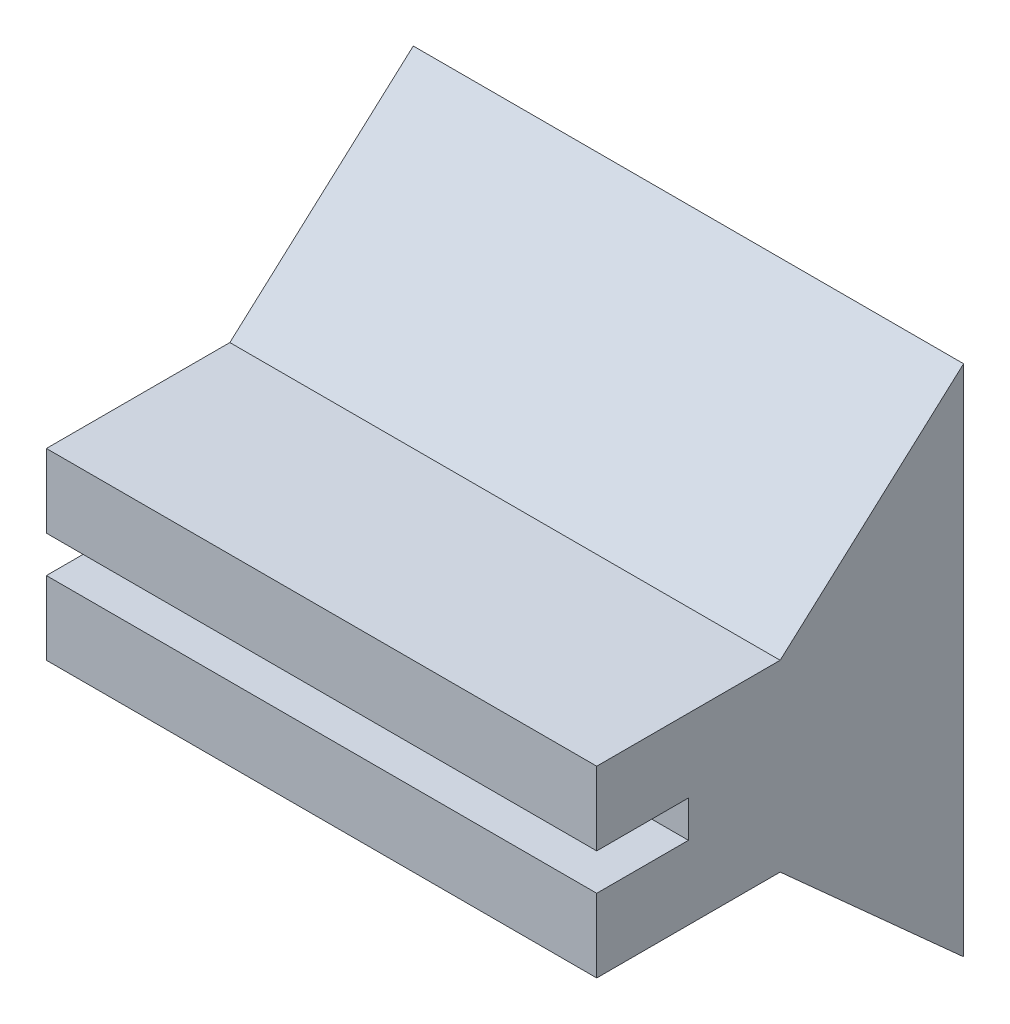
ISO-10303-21;
HEADER;
FILE_DESCRIPTION(('STEP AP214'),'2;1');
FILE_NAME('part.step','',(''),(''),'','','');
FILE_SCHEMA(('AUTOMOTIVE_DESIGN { 1 0 10303 214 1 1 1 1 }'));
ENDSEC;
DATA;
#1=APPLICATION_CONTEXT('core data for automotive mechanical design processes');
#2=APPLICATION_PROTOCOL_DEFINITION('international standard','automotive_design',2000,#1);
#3=PRODUCT_CONTEXT('',#1,'mechanical');
#4=PRODUCT('Part','Part','',(#3));
#5=PRODUCT_RELATED_PRODUCT_CATEGORY('part','',(#4));
#6=PRODUCT_DEFINITION_FORMATION('','',#4);
#7=PRODUCT_DEFINITION_CONTEXT('part definition',#1,'design');
#8=PRODUCT_DEFINITION('design','',#6,#7);
#9=PRODUCT_DEFINITION_SHAPE('','',#8);
#10=(LENGTH_UNIT() NAMED_UNIT(*) SI_UNIT(.MILLI.,.METRE.));
#11=(NAMED_UNIT(*) PLANE_ANGLE_UNIT() SI_UNIT($,.RADIAN.));
#12=(NAMED_UNIT(*) SI_UNIT($,.STERADIAN.) SOLID_ANGLE_UNIT());
#13=UNCERTAINTY_MEASURE_WITH_UNIT(LENGTH_MEASURE(1.E-05),#10,'distance_accuracy_value','');
#14=(GEOMETRIC_REPRESENTATION_CONTEXT(3) GLOBAL_UNCERTAINTY_ASSIGNED_CONTEXT((#13)) GLOBAL_UNIT_ASSIGNED_CONTEXT((#10,
#11,#12)) REPRESENTATION_CONTEXT('',''));
#15=CARTESIAN_POINT('',(0.,0.,0.));
#16=DIRECTION('',(0.,0.,1.));
#17=DIRECTION('',(1.,0.,0.));
#18=AXIS2_PLACEMENT_3D('',#15,#16,#17);
#19=CARTESIAN_POINT('',(-15.,-5.,20.));
#20=DIRECTION('',(0.,1.,0.));
#21=DIRECTION('',(0.,0.,1.));
#22=AXIS2_PLACEMENT_3D('',#19,#20,#21);
#23=PLANE('',#22);
#24=DIRECTION('',(-1.,0.,0.));
#25=VECTOR('',#24,1.);
#26=CARTESIAN_POINT('',(15.,-5.,10.));
#27=LINE('',#26,#25);
#28=CARTESIAN_POINT('',(15.,-5.,10.));
#29=VERTEX_POINT('',#28);
#30=CARTESIAN_POINT('',(-15.,-5.,10.));
#31=VERTEX_POINT('',#30);
#32=EDGE_CURVE('E62',#29,#31,#27,.T.);
#33=ORIENTED_EDGE('',*,*,#32,.F.);
#34=DIRECTION('',(0.,0.,-1.));
#35=VECTOR('',#34,1.);
#36=CARTESIAN_POINT('',(15.,-5.,20.));
#37=LINE('',#36,#35);
#38=CARTESIAN_POINT('',(15.,-5.,20.));
#39=VERTEX_POINT('',#38);
#40=EDGE_CURVE('E187',#39,#29,#37,.T.);
#41=ORIENTED_EDGE('',*,*,#40,.F.);
#42=DIRECTION('',(1.,0.,0.));
#43=VECTOR('',#42,1.);
#44=CARTESIAN_POINT('',(-15.,-5.,20.));
#45=LINE('',#44,#43);
#46=CARTESIAN_POINT('',(-15.,-5.,20.));
#47=VERTEX_POINT('',#46);
#48=EDGE_CURVE('E185',#47,#39,#45,.T.);
#49=ORIENTED_EDGE('',*,*,#48,.F.);
#50=DIRECTION('',(0.,0.,-1.));
#51=VECTOR('',#50,1.);
#52=CARTESIAN_POINT('',(-15.,-5.,20.));
#53=LINE('',#52,#51);
#54=EDGE_CURVE('E190',#47,#31,#53,.T.);
#55=ORIENTED_EDGE('',*,*,#54,.T.);
#56=EDGE_LOOP('',(#33,#41,#49,#55));
#57=FACE_BOUND('',#56,.T.);
#58=ADVANCED_FACE('F39',(#57),#23,.F.);
#59=CARTESIAN_POINT('',(0.,0.,20.));
#60=DIRECTION('',(0.,0.,-1.));
#61=DIRECTION('',(-1.,0.,0.));
#62=AXIS2_PLACEMENT_3D('',#59,#60,#61);
#63=PLANE('',#62);
#64=DIRECTION('',(0.,1.,0.));
#65=VECTOR('',#64,1.);
#66=CARTESIAN_POINT('',(15.,-5.,20.));
#67=LINE('',#66,#65);
#68=CARTESIAN_POINT('',(15.,-1.,20.));
#69=VERTEX_POINT('',#68);
#70=EDGE_CURVE('E176',#39,#69,#67,.T.);
#71=ORIENTED_EDGE('',*,*,#70,.T.);
#72=DIRECTION('',(1.,0.,0.));
#73=VECTOR('',#72,1.);
#74=CARTESIAN_POINT('',(-15.,-1.,20.));
#75=LINE('',#74,#73);
#76=CARTESIAN_POINT('',(-15.,-1.,20.));
#77=VERTEX_POINT('',#76);
#78=EDGE_CURVE('E156',#77,#69,#75,.T.);
#79=ORIENTED_EDGE('',*,*,#78,.F.);
#80=DIRECTION('',(0.,-1.,0.));
#81=VECTOR('',#80,1.);
#82=CARTESIAN_POINT('',(-15.,-5.,20.));
#83=LINE('',#82,#81);
#84=EDGE_CURVE('E181',#77,#47,#83,.T.);
#85=ORIENTED_EDGE('',*,*,#84,.T.);
#86=ORIENTED_EDGE('',*,*,#48,.T.);
#87=EDGE_LOOP('',(#71,#79,#85,#86));
#88=FACE_BOUND('',#87,.T.);
#89=ADVANCED_FACE('F201',(#88),#63,.F.);
#90=CARTESIAN_POINT('',(15.,-5.,20.));
#91=DIRECTION('',(-1.,0.,0.));
#92=DIRECTION('',(0.,0.,1.));
#93=AXIS2_PLACEMENT_3D('',#90,#91,#92);
#94=PLANE('',#93);
#95=DIRECTION('',(0.,1.,0.));
#96=VECTOR('',#95,1.);
#97=CARTESIAN_POINT('',(15.,-1.,15.));
#98=LINE('',#97,#96);
#99=CARTESIAN_POINT('',(15.,-1.,15.));
#100=VERTEX_POINT('',#99);
#101=CARTESIAN_POINT('',(15.,1.,15.));
#102=VERTEX_POINT('',#101);
#103=EDGE_CURVE('E152',#100,#102,#98,.T.);
#104=ORIENTED_EDGE('',*,*,#103,.F.);
#105=DIRECTION('',(0.,0.,1.));
#106=VECTOR('',#105,1.);
#107=CARTESIAN_POINT('',(15.,-1.,15.));
#108=LINE('',#107,#106);
#109=EDGE_CURVE('E167',#100,#69,#108,.T.);
#110=ORIENTED_EDGE('',*,*,#109,.T.);
#111=ORIENTED_EDGE('',*,*,#70,.F.);
#112=ORIENTED_EDGE('',*,*,#40,.T.);
#113=DIRECTION('',(0.,0.66896473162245,0.743294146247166));
#114=VECTOR('',#113,1.);
#115=CARTESIAN_POINT('',(15.,-14.,0.));
#116=LINE('',#115,#114);
#117=CARTESIAN_POINT('',(15.,-14.,0.));
#118=VERTEX_POINT('',#117);
#119=EDGE_CURVE('E142',#118,#29,#116,.T.);
#120=ORIENTED_EDGE('',*,*,#119,.F.);
#121=DIRECTION('',(0.,1.,0.));
#122=VECTOR('',#121,1.);
#123=CARTESIAN_POINT('',(15.,-5.,0.));
#124=LINE('',#123,#122);
#125=CARTESIAN_POINT('',(15.,14.,0.));
#126=VERTEX_POINT('',#125);
#127=EDGE_CURVE('E128',#118,#126,#124,.T.);
#128=ORIENTED_EDGE('',*,*,#127,.T.);
#129=DIRECTION('',(0.,0.66896473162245,-0.743294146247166));
#130=VECTOR('',#129,1.);
#131=CARTESIAN_POINT('',(15.,14.,0.));
#132=LINE('',#131,#130);
#133=CARTESIAN_POINT('',(15.,5.,10.));
#134=VERTEX_POINT('',#133);
#135=EDGE_CURVE('E132',#134,#126,#132,.T.);
#136=ORIENTED_EDGE('',*,*,#135,.F.);
#137=DIRECTION('',(0.,0.,-1.));
#138=VECTOR('',#137,1.);
#139=CARTESIAN_POINT('',(15.,5.,20.));
#140=LINE('',#139,#138);
#141=CARTESIAN_POINT('',(15.,5.,20.));
#142=VERTEX_POINT('',#141);
#143=EDGE_CURVE('E11',#142,#134,#140,.T.);
#144=ORIENTED_EDGE('',*,*,#143,.F.);
#145=CARTESIAN_POINT('',(15.,1.,20.));
#146=VERTEX_POINT('',#145);
#147=EDGE_CURVE('E127',#146,#142,#67,.T.);
#148=ORIENTED_EDGE('',*,*,#147,.F.);
#149=DIRECTION('',(0.,0.,1.));
#150=VECTOR('',#149,1.);
#151=CARTESIAN_POINT('',(15.,1.,15.));
#152=LINE('',#151,#150);
#153=EDGE_CURVE('E164',#102,#146,#152,.T.);
#154=ORIENTED_EDGE('',*,*,#153,.F.);
#155=EDGE_LOOP('',(#104,#110,#111,#112,#120,#128,#136,#144,#148,#154));
#156=FACE_BOUND('',#155,.T.);
#157=ADVANCED_FACE('F41',(#156),#94,.F.);
#158=CARTESIAN_POINT('',(-15.,5.,20.));
#159=DIRECTION('',(0.,-1.,0.));
#160=DIRECTION('',(0.,0.,-1.));
#161=AXIS2_PLACEMENT_3D('',#158,#159,#160);
#162=PLANE('',#161);
#163=ORIENTED_EDGE('',*,*,#143,.T.);
#164=DIRECTION('',(-1.,0.,0.));
#165=VECTOR('',#164,1.);
#166=CARTESIAN_POINT('',(15.,5.,10.));
#167=LINE('',#166,#165);
#168=CARTESIAN_POINT('',(-15.,5.,10.));
#169=VERTEX_POINT('',#168);
#170=EDGE_CURVE('E133',#134,#169,#167,.T.);
#171=ORIENTED_EDGE('',*,*,#170,.T.);
#172=DIRECTION('',(0.,0.,-1.));
#173=VECTOR('',#172,1.);
#174=CARTESIAN_POINT('',(-15.,5.,20.));
#175=LINE('',#174,#173);
#176=CARTESIAN_POINT('',(-15.,5.,20.));
#177=VERTEX_POINT('',#176);
#178=EDGE_CURVE('E47',#177,#169,#175,.T.);
#179=ORIENTED_EDGE('',*,*,#178,.F.);
#180=DIRECTION('',(-1.,0.,0.));
#181=VECTOR('',#180,1.);
#182=CARTESIAN_POINT('',(-15.,5.,20.));
#183=LINE('',#182,#181);
#184=EDGE_CURVE('E179',#142,#177,#183,.T.);
#185=ORIENTED_EDGE('',*,*,#184,.F.);
#186=EDGE_LOOP('',(#163,#171,#179,#185));
#187=FACE_BOUND('',#186,.T.);
#188=ADVANCED_FACE('F219',(#187),#162,.F.);
#189=CARTESIAN_POINT('',(-15.,-5.,20.));
#190=DIRECTION('',(1.,0.,0.));
#191=DIRECTION('',(0.,0.,-1.));
#192=AXIS2_PLACEMENT_3D('',#189,#190,#191);
#193=PLANE('',#192);
#194=ORIENTED_EDGE('',*,*,#84,.F.);
#195=DIRECTION('',(0.,0.,1.));
#196=VECTOR('',#195,1.);
#197=CARTESIAN_POINT('',(-15.,-1.,15.));
#198=LINE('',#197,#196);
#199=CARTESIAN_POINT('',(-15.,-1.,15.));
#200=VERTEX_POINT('',#199);
#201=EDGE_CURVE('E170',#200,#77,#198,.T.);
#202=ORIENTED_EDGE('',*,*,#201,.F.);
#203=DIRECTION('',(0.,-1.,0.));
#204=VECTOR('',#203,1.);
#205=CARTESIAN_POINT('',(-15.,-1.,15.));
#206=LINE('',#205,#204);
#207=CARTESIAN_POINT('',(-15.,1.,15.));
#208=VERTEX_POINT('',#207);
#209=EDGE_CURVE('E159',#208,#200,#206,.T.);
#210=ORIENTED_EDGE('',*,*,#209,.F.);
#211=DIRECTION('',(0.,0.,1.));
#212=VECTOR('',#211,1.);
#213=CARTESIAN_POINT('',(-15.,1.,15.));
#214=LINE('',#213,#212);
#215=CARTESIAN_POINT('',(-15.,1.,20.));
#216=VERTEX_POINT('',#215);
#217=EDGE_CURVE('E172',#208,#216,#214,.T.);
#218=ORIENTED_EDGE('',*,*,#217,.T.);
#219=EDGE_CURVE('E182',#177,#216,#83,.T.);
#220=ORIENTED_EDGE('',*,*,#219,.F.);
#221=ORIENTED_EDGE('',*,*,#178,.T.);
#222=DIRECTION('',(0.,0.66896473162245,-0.743294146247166));
#223=VECTOR('',#222,1.);
#224=CARTESIAN_POINT('',(-15.,14.,0.));
#225=LINE('',#224,#223);
#226=CARTESIAN_POINT('',(-15.,14.,0.));
#227=VERTEX_POINT('',#226);
#228=EDGE_CURVE('E54',#169,#227,#225,.T.);
#229=ORIENTED_EDGE('',*,*,#228,.T.);
#230=DIRECTION('',(0.,-1.,0.));
#231=VECTOR('',#230,1.);
#232=CARTESIAN_POINT('',(-15.,-5.,0.));
#233=LINE('',#232,#231);
#234=CARTESIAN_POINT('',(-15.,-14.,0.));
#235=VERTEX_POINT('',#234);
#236=EDGE_CURVE('E118',#227,#235,#233,.T.);
#237=ORIENTED_EDGE('',*,*,#236,.T.);
#238=DIRECTION('',(0.,0.66896473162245,0.743294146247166));
#239=VECTOR('',#238,1.);
#240=CARTESIAN_POINT('',(-15.,-14.,0.));
#241=LINE('',#240,#239);
#242=EDGE_CURVE('E140',#235,#31,#241,.T.);
#243=ORIENTED_EDGE('',*,*,#242,.T.);
#244=ORIENTED_EDGE('',*,*,#54,.F.);
#245=EDGE_LOOP('',(#194,#202,#210,#218,#220,#221,#229,#237,#243,#244));
#246=FACE_BOUND('',#245,.T.);
#247=ADVANCED_FACE('F137',(#246),#193,.F.);
#248=ORIENTED_EDGE('',*,*,#219,.T.);
#249=DIRECTION('',(-1.,0.,0.));
#250=VECTOR('',#249,1.);
#251=CARTESIAN_POINT('',(-15.,1.,20.));
#252=LINE('',#251,#250);
#253=EDGE_CURVE('E150',#146,#216,#252,.T.);
#254=ORIENTED_EDGE('',*,*,#253,.F.);
#255=ORIENTED_EDGE('',*,*,#147,.T.);
#256=ORIENTED_EDGE('',*,*,#184,.T.);
#257=EDGE_LOOP('',(#248,#254,#255,#256));
#258=FACE_BOUND('',#257,.T.);
#259=ADVANCED_FACE('F216',(#258),#63,.F.);
#260=CARTESIAN_POINT('',(0.,0.,0.));
#261=DIRECTION('',(0.,0.,-1.));
#262=DIRECTION('',(-1.,0.,0.));
#263=AXIS2_PLACEMENT_3D('',#260,#261,#262);
#264=PLANE('',#263);
#265=ORIENTED_EDGE('',*,*,#127,.F.);
#266=DIRECTION('',(-1.,0.,0.));
#267=VECTOR('',#266,1.);
#268=CARTESIAN_POINT('',(15.,-14.,0.));
#269=LINE('',#268,#267);
#270=EDGE_CURVE('E123',#118,#235,#269,.T.);
#271=ORIENTED_EDGE('',*,*,#270,.T.);
#272=ORIENTED_EDGE('',*,*,#236,.F.);
#273=DIRECTION('',(-1.,0.,0.));
#274=VECTOR('',#273,1.);
#275=CARTESIAN_POINT('',(15.,14.,0.));
#276=LINE('',#275,#274);
#277=EDGE_CURVE('E120',#126,#227,#276,.T.);
#278=ORIENTED_EDGE('',*,*,#277,.F.);
#279=EDGE_LOOP('',(#265,#271,#272,#278));
#280=FACE_BOUND('',#279,.T.);
#281=ADVANCED_FACE('F119',(#280),#264,.T.);
#282=CARTESIAN_POINT('',(-15.,-1.,15.));
#283=DIRECTION('',(0.,-1.,0.));
#284=DIRECTION('',(0.,0.,-1.));
#285=AXIS2_PLACEMENT_3D('',#282,#283,#284);
#286=PLANE('',#285);
#287=ORIENTED_EDGE('',*,*,#78,.T.);
#288=ORIENTED_EDGE('',*,*,#109,.F.);
#289=DIRECTION('',(1.,0.,0.));
#290=VECTOR('',#289,1.);
#291=CARTESIAN_POINT('',(-15.,-1.,15.));
#292=LINE('',#291,#290);
#293=EDGE_CURVE('E161',#200,#100,#292,.T.);
#294=ORIENTED_EDGE('',*,*,#293,.F.);
#295=ORIENTED_EDGE('',*,*,#201,.T.);
#296=EDGE_LOOP('',(#287,#288,#294,#295));
#297=FACE_BOUND('',#296,.T.);
#298=ADVANCED_FACE('F206',(#297),#286,.F.);
#299=CARTESIAN_POINT('',(-15.,1.,15.));
#300=DIRECTION('',(0.,1.,0.));
#301=DIRECTION('',(0.,0.,1.));
#302=AXIS2_PLACEMENT_3D('',#299,#300,#301);
#303=PLANE('',#302);
#304=ORIENTED_EDGE('',*,*,#253,.T.);
#305=ORIENTED_EDGE('',*,*,#217,.F.);
#306=DIRECTION('',(-1.,0.,0.));
#307=VECTOR('',#306,1.);
#308=CARTESIAN_POINT('',(-15.,1.,15.));
#309=LINE('',#308,#307);
#310=EDGE_CURVE('E155',#102,#208,#309,.T.);
#311=ORIENTED_EDGE('',*,*,#310,.F.);
#312=ORIENTED_EDGE('',*,*,#153,.T.);
#313=EDGE_LOOP('',(#304,#305,#311,#312));
#314=FACE_BOUND('',#313,.T.);
#315=ADVANCED_FACE('F214',(#314),#303,.F.);
#316=CARTESIAN_POINT('',(0.,0.,15.));
#317=DIRECTION('',(0.,0.,-1.));
#318=DIRECTION('',(-1.,0.,0.));
#319=AXIS2_PLACEMENT_3D('',#316,#317,#318);
#320=PLANE('',#319);
#321=ORIENTED_EDGE('',*,*,#103,.T.);
#322=ORIENTED_EDGE('',*,*,#310,.T.);
#323=ORIENTED_EDGE('',*,*,#209,.T.);
#324=ORIENTED_EDGE('',*,*,#293,.T.);
#325=EDGE_LOOP('',(#321,#322,#323,#324));
#326=FACE_BOUND('',#325,.T.);
#327=ADVANCED_FACE('F208',(#326),#320,.F.);
#328=CARTESIAN_POINT('',(15.,-14.,0.));
#329=DIRECTION('',(0.,-0.743294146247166,0.66896473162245));
#330=DIRECTION('',(0.,-0.66896473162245,-0.743294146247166));
#331=AXIS2_PLACEMENT_3D('',#328,#329,#330);
#332=PLANE('',#331);
#333=ORIENTED_EDGE('',*,*,#242,.F.);
#334=ORIENTED_EDGE('',*,*,#270,.F.);
#335=ORIENTED_EDGE('',*,*,#119,.T.);
#336=ORIENTED_EDGE('',*,*,#32,.T.);
#337=EDGE_LOOP('',(#333,#334,#335,#336));
#338=FACE_BOUND('',#337,.T.);
#339=ADVANCED_FACE('F194',(#338),#332,.T.);
#340=CARTESIAN_POINT('',(15.,14.,0.));
#341=DIRECTION('',(0.,0.743294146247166,0.66896473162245));
#342=DIRECTION('',(0.,-0.66896473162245,0.743294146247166));
#343=AXIS2_PLACEMENT_3D('',#340,#341,#342);
#344=PLANE('',#343);
#345=ORIENTED_EDGE('',*,*,#228,.F.);
#346=ORIENTED_EDGE('',*,*,#170,.F.);
#347=ORIENTED_EDGE('',*,*,#135,.T.);
#348=ORIENTED_EDGE('',*,*,#277,.T.);
#349=EDGE_LOOP('',(#345,#346,#347,#348));
#350=FACE_BOUND('',#349,.T.);
#351=ADVANCED_FACE('F130',(#350),#344,.T.);
#352=CLOSED_SHELL('',(#58,#89,#157,#188,#247,#259,#281,#298,#315,#327,#339,#351));
#353=MANIFOLD_SOLID_BREP('B2',#352);
#354=ADVANCED_BREP_SHAPE_REPRESENTATION('',(#18,#353),#14);
#355=SHAPE_DEFINITION_REPRESENTATION(#9,#354);
ENDSEC;
END-ISO-10303-21;
